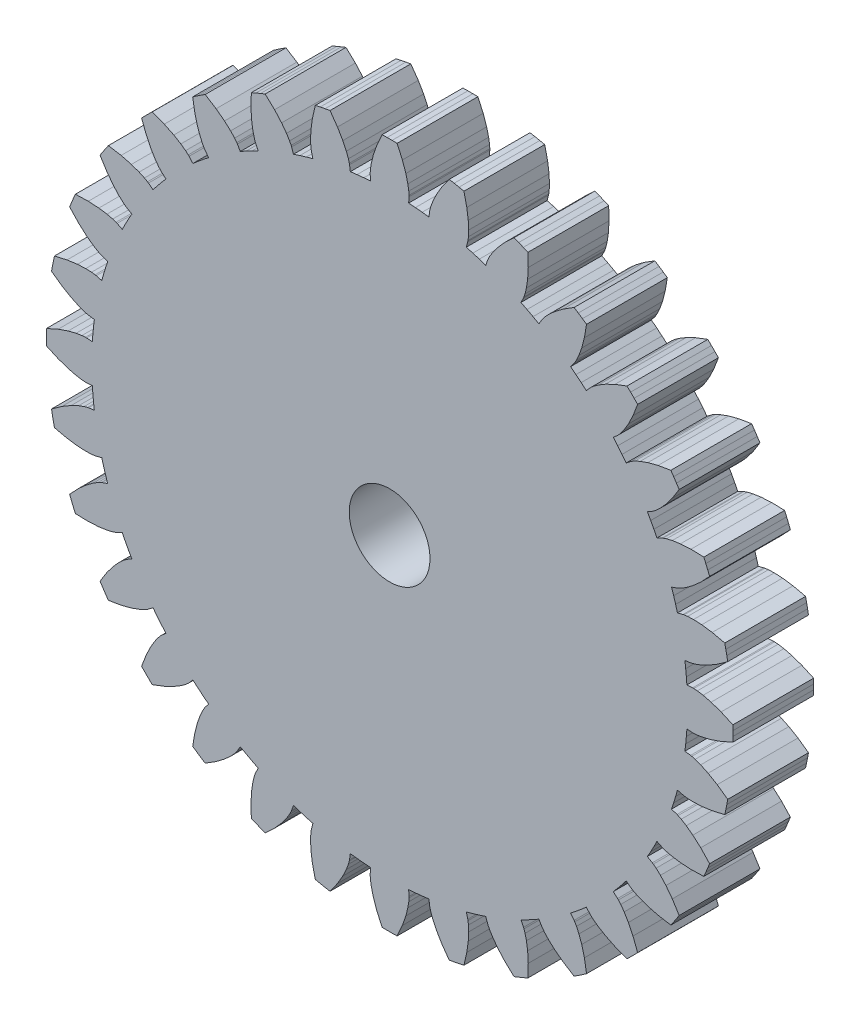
from build123d import *

# Parameters (mm, degrees)
SKETCH_1_R              = 3
SPURGEAR_M1_5_Z32_DEPTH = 6


with BuildPart() as part:
    # Sketch 1 → SpurGear_m1.5_z32 (new body)
    with BuildSketch(Plane.XY):
        Polygon((22.079715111, -1.414851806), (22.506462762, -1.442197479), (22.59366421, -1.442664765), (22.854554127, -1.423633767), (23.285036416, -1.354687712), (23.877027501, -1.206096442), (24.618555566, -0.949280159), (25.493910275, -0.557260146), (25.49932334, -0.185766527), (25.49932334, 0.185766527), (25.493910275, 0.557260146), (24.618555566, 0.949280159), (23.877027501, 1.206096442), (23.285036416, 1.354687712), (22.854554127, 1.423633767), (22.59366421, 1.442664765), (22.506462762, 1.442197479), (22.079715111, 1.414851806), (22.041742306, 1.917608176), (21.992323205, 2.419368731), (21.93148347, 2.919872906), (22.355366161, 2.976307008), (22.440983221, 2.99286086), (22.693147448, 3.06242328), (23.101907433, 3.214027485), (23.653534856, 3.475255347), (24.330712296, 3.871801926), (25.112767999, 4.427062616), (25.045602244, 4.792474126), (24.973119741, 5.156868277), (24.895335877, 5.520167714), (23.960321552, 5.73388194), (23.182939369, 5.841098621), (22.573334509, 5.87134302), (22.137673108, 5.854981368), (21.878083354, 5.822749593), (21.79264862, 5.805279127), (21.379435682, 5.695204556), (21.244109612, 6.180892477), (21.097751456, 6.663370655), (20.94043722, 7.142388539), (21.345165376, 7.280433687), (21.425907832, 7.313372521), (21.659655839, 7.430793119), (22.030985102, 7.659229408), (22.521050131, 8.023055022), (23.107853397, 8.544092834), (23.766556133, 9.241255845), (23.629392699, 9.586542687), (23.487213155, 9.929794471), (23.340047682, 10.270938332), (22.381305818, 10.298133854), (21.597943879, 10.251630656), (20.994152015, 10.162365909), (20.570053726, 10.061325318), (20.321740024, 9.979069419), (20.241355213, 9.945267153), (19.857556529, 9.756693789), (19.630077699, 10.206648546), (19.392404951, 10.651302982), (19.14466171, 11.090426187), (19.514681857, 11.304777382), (19.587446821, 11.352835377), (19.793795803, 11.513601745), (20.11342437, 11.810091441), (20.52309408, 12.262533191), (20.996972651, 12.888039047), (21.507008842, 13.700312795), (21.305118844, 14.012205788), (21.098706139, 14.321124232), (20.887814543, 14.62700255), (19.942189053, 14.466634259), (19.182951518, 14.268198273), (18.608176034, 14.062854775), (18.211938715, 13.881018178), (17.984443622, 13.751899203), (17.912197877, 13.70306414), (17.572562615, 13.443238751), (17.261672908, 13.840168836), (16.941819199, 14.229911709), (16.613167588, 14.612264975), (16.934260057, 14.894684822), (16.996251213, 14.956015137), (17.167271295, 15.153949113), (17.422916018, 15.507098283), (17.736447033, 16.030769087), (18.079190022, 16.736705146), (18.420959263, 17.632874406), (18.16210122, 17.899387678), (17.899387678, 18.16210122), (17.632874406, 18.420959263), (16.736705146, 18.079190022), (16.030769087, 17.736447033), (15.507098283, 17.422916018), (15.153949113, 17.167271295), (14.956015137, 16.996251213), (14.894684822, 16.934260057), (14.612264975, 16.613167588), (14.229911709, 16.941819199), (13.840168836, 17.261672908), (13.443238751, 17.572562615), (13.70306414, 17.912197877), (13.751899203, 17.984443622), (13.881018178, 18.211938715), (14.062854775, 18.608176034), (14.268198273, 19.182951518), (14.466634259, 19.942189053), (14.62700255, 20.887814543), (14.321124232, 21.098706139), (14.012205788, 21.305118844), (13.700312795, 21.507008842), (12.888039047, 20.996972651), (12.262533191, 20.52309408), (11.810091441, 20.11342437), (11.513601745, 19.793795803), (11.352835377, 19.587446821), (11.304777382, 19.514681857), (11.090426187, 19.14466171), (10.651302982, 19.392404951), (10.206648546, 19.630077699), (9.756693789, 19.857556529), (9.945267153, 20.241355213), (9.979069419, 20.321740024), (10.061325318, 20.570053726), (10.162365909, 20.994152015), (10.251630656, 21.597943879), (10.298133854, 22.381305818), (10.270938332, 23.340047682), (9.929794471, 23.487213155), (9.586542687, 23.629392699), (9.241255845, 23.766556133), (8.544092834, 23.107853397), (8.023055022, 22.521050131), (7.659229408, 22.030985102), (7.430793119, 21.659655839), (7.313372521, 21.425907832), (7.280433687, 21.345165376), (7.142388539, 20.94043722), (6.663370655, 21.097751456), (6.180892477, 21.244109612), (5.695204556, 21.379435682), (5.805279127, 21.79264862), (5.822749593, 21.878083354), (5.854981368, 22.137673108), (5.87134302, 22.573334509), (5.841098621, 23.182939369), (5.73388194, 23.960321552), (5.520167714, 24.895335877), (5.156868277, 24.973119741), (4.792474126, 25.045602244), (4.427062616, 25.112767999), (3.871801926, 24.330712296), (3.475255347, 23.653534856), (3.214027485, 23.101907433), (3.06242328, 22.693147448), (2.99286086, 22.440983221), (2.976307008, 22.355366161), (2.919872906, 21.93148347), (2.419368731, 21.992323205), (1.917608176, 22.041742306), (1.414851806, 22.079715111), (1.442197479, 22.506462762), (1.442664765, 22.59366421), (1.423633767, 22.854554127), (1.354687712, 23.285036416), (1.206096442, 23.877027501), (0.949280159, 24.618555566), (0.557260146, 25.493910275), (0.185766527, 25.49932334), (-0.185766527, 25.49932334), (-0.557260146, 25.493910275), (-0.949280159, 24.618555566), (-1.206096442, 23.877027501), (-1.354687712, 23.285036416), (-1.423633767, 22.854554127), (-1.442664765, 22.59366421), (-1.442197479, 22.506462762), (-1.414851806, 22.079715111), (-1.917608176, 22.041742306), (-2.419368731, 21.992323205), (-2.919872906, 21.93148347), (-2.976307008, 22.355366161), (-2.99286086, 22.440983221), (-3.06242328, 22.693147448), (-3.214027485, 23.101907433), (-3.475255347, 23.653534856), (-3.871801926, 24.330712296), (-4.427062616, 25.112767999), (-4.792474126, 25.045602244), (-5.156868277, 24.973119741), (-5.520167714, 24.895335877), (-5.73388194, 23.960321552), (-5.841098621, 23.182939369), (-5.87134302, 22.573334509), (-5.854981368, 22.137673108), (-5.822749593, 21.878083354), (-5.805279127, 21.79264862), (-5.695204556, 21.379435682), (-6.180892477, 21.244109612), (-6.663370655, 21.097751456), (-7.142388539, 20.94043722), (-7.280433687, 21.345165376), (-7.313372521, 21.425907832), (-7.430793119, 21.659655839), (-7.659229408, 22.030985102), (-8.023055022, 22.521050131), (-8.544092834, 23.107853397), (-9.241255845, 23.766556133), (-9.586542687, 23.629392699), (-9.929794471, 23.487213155), (-10.270938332, 23.340047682), (-10.298133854, 22.381305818), (-10.251630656, 21.597943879), (-10.162365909, 20.994152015), (-10.061325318, 20.570053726), (-9.979069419, 20.321740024), (-9.945267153, 20.241355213), (-9.756693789, 19.857556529), (-10.206648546, 19.630077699), (-10.651302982, 19.392404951), (-11.090426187, 19.14466171), (-11.304777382, 19.514681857), (-11.352835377, 19.587446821), (-11.513601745, 19.793795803), (-11.810091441, 20.11342437), (-12.262533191, 20.52309408), (-12.888039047, 20.996972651), (-13.700312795, 21.507008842), (-14.012205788, 21.305118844), (-14.321124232, 21.098706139), (-14.62700255, 20.887814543), (-14.466634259, 19.942189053), (-14.268198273, 19.182951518), (-14.062854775, 18.608176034), (-13.881018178, 18.211938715), (-13.751899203, 17.984443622), (-13.70306414, 17.912197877), (-13.443238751, 17.572562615), (-13.840168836, 17.261672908), (-14.229911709, 16.941819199), (-14.612264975, 16.613167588), (-14.894684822, 16.934260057), (-14.956015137, 16.996251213), (-15.153949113, 17.167271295), (-15.507098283, 17.422916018), (-16.030769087, 17.736447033), (-16.736705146, 18.079190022), (-17.632874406, 18.420959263), (-17.899387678, 18.16210122), (-18.16210122, 17.899387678), (-18.420959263, 17.632874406), (-18.079190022, 16.736705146), (-17.736447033, 16.030769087), (-17.422916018, 15.507098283), (-17.167271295, 15.153949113), (-16.996251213, 14.956015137), (-16.934260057, 14.894684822), (-16.613167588, 14.612264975), (-16.941819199, 14.229911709), (-17.261672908, 13.840168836), (-17.572562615, 13.443238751), (-17.912197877, 13.70306414), (-17.984443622, 13.751899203), (-18.211938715, 13.881018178), (-18.608176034, 14.062854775), (-19.182951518, 14.268198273), (-19.942189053, 14.466634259), (-20.887814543, 14.62700255), (-21.098706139, 14.321124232), (-21.305118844, 14.012205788), (-21.507008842, 13.700312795), (-20.996972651, 12.888039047), (-20.52309408, 12.262533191), (-20.11342437, 11.810091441), (-19.793795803, 11.513601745), (-19.587446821, 11.352835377), (-19.514681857, 11.304777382), (-19.14466171, 11.090426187), (-19.392404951, 10.651302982), (-19.630077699, 10.206648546), (-19.857556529, 9.756693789), (-20.241355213, 9.945267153), (-20.321740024, 9.979069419), (-20.570053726, 10.061325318), (-20.994152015, 10.162365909), (-21.597943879, 10.251630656), (-22.381305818, 10.298133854), (-23.340047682, 10.270938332), (-23.487213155, 9.929794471), (-23.629392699, 9.586542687), (-23.766556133, 9.241255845), (-23.107853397, 8.544092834), (-22.521050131, 8.023055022), (-22.030985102, 7.659229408), (-21.659655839, 7.430793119), (-21.425907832, 7.313372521), (-21.345165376, 7.280433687), (-20.94043722, 7.142388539), (-21.097751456, 6.663370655), (-21.244109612, 6.180892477), (-21.379435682, 5.695204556), (-21.79264862, 5.805279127), (-21.878083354, 5.822749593), (-22.137673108, 5.854981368), (-22.573334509, 5.87134302), (-23.182939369, 5.841098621), (-23.960321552, 5.73388194), (-24.895335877, 5.520167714), (-24.973119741, 5.156868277), (-25.045602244, 4.792474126), (-25.112767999, 4.427062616), (-24.330712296, 3.871801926), (-23.653534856, 3.475255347), (-23.101907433, 3.214027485), (-22.693147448, 3.06242328), (-22.440983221, 2.99286086), (-22.355366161, 2.976307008), (-21.93148347, 2.919872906), (-21.992323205, 2.419368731), (-22.041742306, 1.917608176), (-22.079715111, 1.414851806), (-22.506462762, 1.442197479), (-22.59366421, 1.442664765), (-22.854554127, 1.423633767), (-23.285036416, 1.354687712), (-23.877027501, 1.206096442), (-24.618555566, 0.949280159), (-25.493910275, 0.557260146), (-25.49932334, 0.185766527), (-25.49932334, -0.185766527), (-25.493910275, -0.557260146), (-24.618555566, -0.949280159), (-23.877027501, -1.206096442), (-23.285036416, -1.354687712), (-22.854554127, -1.423633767), (-22.59366421, -1.442664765), (-22.506462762, -1.442197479), (-22.079715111, -1.414851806), (-22.041742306, -1.917608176), (-21.992323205, -2.419368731), (-21.93148347, -2.919872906), (-22.355366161, -2.976307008), (-22.440983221, -2.99286086), (-22.693147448, -3.06242328), (-23.101907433, -3.214027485), (-23.653534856, -3.475255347), (-24.330712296, -3.871801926), (-25.112767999, -4.427062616), (-25.045602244, -4.792474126), (-24.973119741, -5.156868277), (-24.895335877, -5.520167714), (-23.960321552, -5.73388194), (-23.182939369, -5.841098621), (-22.573334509, -5.87134302), (-22.137673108, -5.854981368), (-21.878083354, -5.822749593), (-21.79264862, -5.805279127), (-21.379435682, -5.695204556), (-21.244109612, -6.180892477), (-21.097751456, -6.663370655), (-20.94043722, -7.142388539), (-21.345165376, -7.280433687), (-21.425907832, -7.313372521), (-21.659655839, -7.430793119), (-22.030985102, -7.659229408), (-22.521050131, -8.023055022), (-23.107853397, -8.544092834), (-23.766556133, -9.241255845), (-23.629392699, -9.586542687), (-23.487213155, -9.929794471), (-23.340047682, -10.270938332), (-22.381305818, -10.298133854), (-21.597943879, -10.251630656), (-20.994152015, -10.162365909), (-20.570053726, -10.061325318), (-20.321740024, -9.979069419), (-20.241355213, -9.945267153), (-19.857556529, -9.756693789), (-19.630077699, -10.206648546), (-19.392404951, -10.651302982), (-19.14466171, -11.090426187), (-19.514681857, -11.304777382), (-19.587446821, -11.352835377), (-19.793795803, -11.513601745), (-20.11342437, -11.810091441), (-20.52309408, -12.262533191), (-20.996972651, -12.888039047), (-21.507008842, -13.700312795), (-21.305118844, -14.012205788), (-21.098706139, -14.321124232), (-20.887814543, -14.62700255), (-19.942189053, -14.466634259), (-19.182951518, -14.268198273), (-18.608176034, -14.062854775), (-18.211938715, -13.881018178), (-17.984443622, -13.751899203), (-17.912197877, -13.70306414), (-17.572562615, -13.443238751), (-17.261672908, -13.840168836), (-16.941819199, -14.229911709), (-16.613167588, -14.612264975), (-16.934260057, -14.894684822), (-16.996251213, -14.956015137), (-17.167271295, -15.153949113), (-17.422916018, -15.507098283), (-17.736447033, -16.030769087), (-18.079190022, -16.736705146), (-18.420959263, -17.632874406), (-18.16210122, -17.899387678), (-17.899387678, -18.16210122), (-17.632874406, -18.420959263), (-16.736705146, -18.079190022), (-16.030769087, -17.736447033), (-15.507098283, -17.422916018), (-15.153949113, -17.167271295), (-14.956015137, -16.996251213), (-14.894684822, -16.934260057), (-14.612264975, -16.613167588), (-14.229911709, -16.941819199), (-13.840168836, -17.261672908), (-13.443238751, -17.572562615), (-13.70306414, -17.912197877), (-13.751899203, -17.984443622), (-13.881018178, -18.211938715), (-14.062854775, -18.608176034), (-14.268198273, -19.182951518), (-14.466634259, -19.942189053), (-14.62700255, -20.887814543), (-14.321124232, -21.098706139), (-14.012205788, -21.305118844), (-13.700312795, -21.507008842), (-12.888039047, -20.996972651), (-12.262533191, -20.52309408), (-11.810091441, -20.11342437), (-11.513601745, -19.793795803), (-11.352835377, -19.587446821), (-11.304777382, -19.514681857), (-11.090426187, -19.14466171), (-10.651302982, -19.392404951), (-10.206648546, -19.630077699), (-9.756693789, -19.857556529), (-9.945267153, -20.241355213), (-9.979069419, -20.321740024), (-10.061325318, -20.570053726), (-10.162365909, -20.994152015), (-10.251630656, -21.597943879), (-10.298133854, -22.381305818), (-10.270938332, -23.340047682), (-9.929794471, -23.487213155), (-9.586542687, -23.629392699), (-9.241255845, -23.766556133), (-8.544092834, -23.107853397), (-8.023055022, -22.521050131), (-7.659229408, -22.030985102), (-7.430793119, -21.659655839), (-7.313372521, -21.425907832), (-7.280433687, -21.345165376), (-7.142388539, -20.94043722), (-6.663370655, -21.097751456), (-6.180892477, -21.244109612), (-5.695204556, -21.379435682), (-5.805279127, -21.79264862), (-5.822749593, -21.878083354), (-5.854981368, -22.137673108), (-5.87134302, -22.573334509), (-5.841098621, -23.182939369), (-5.73388194, -23.960321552), (-5.520167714, -24.895335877), (-5.156868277, -24.973119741), (-4.792474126, -25.045602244), (-4.427062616, -25.112767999), (-3.871801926, -24.330712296), (-3.475255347, -23.653534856), (-3.214027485, -23.101907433), (-3.06242328, -22.693147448), (-2.99286086, -22.440983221), (-2.976307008, -22.355366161), (-2.919872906, -21.93148347), (-2.419368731, -21.992323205), (-1.917608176, -22.041742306), (-1.414851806, -22.079715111), (-1.442197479, -22.506462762), (-1.442664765, -22.59366421), (-1.423633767, -22.854554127), (-1.354687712, -23.285036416), (-1.206096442, -23.877027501), (-0.949280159, -24.618555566), (-0.557260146, -25.493910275), (-0.185766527, -25.49932334), (0.185766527, -25.49932334), (0.557260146, -25.493910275), (0.949280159, -24.618555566), (1.206096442, -23.877027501), (1.354687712, -23.285036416), (1.423633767, -22.854554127), (1.442664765, -22.59366421), (1.442197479, -22.506462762), (1.414851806, -22.079715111), (1.917608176, -22.041742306), (2.419368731, -21.992323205), (2.919872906, -21.93148347), (2.976307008, -22.355366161), (2.99286086, -22.440983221), (3.06242328, -22.693147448), (3.214027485, -23.101907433), (3.475255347, -23.653534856), (3.871801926, -24.330712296), (4.427062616, -25.112767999), (4.792474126, -25.045602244), (5.156868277, -24.973119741), (5.520167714, -24.895335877), (5.73388194, -23.960321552), (5.841098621, -23.182939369), (5.87134302, -22.573334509), (5.854981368, -22.137673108), (5.822749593, -21.878083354), (5.805279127, -21.79264862), (5.695204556, -21.379435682), (6.180892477, -21.244109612), (6.663370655, -21.097751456), (7.142388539, -20.94043722), (7.280433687, -21.345165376), (7.313372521, -21.425907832), (7.430793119, -21.659655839), (7.659229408, -22.030985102), (8.023055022, -22.521050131), (8.544092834, -23.107853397), (9.241255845, -23.766556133), (9.586542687, -23.629392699), (9.929794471, -23.487213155), (10.270938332, -23.340047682), (10.298133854, -22.381305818), (10.251630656, -21.597943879), (10.162365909, -20.994152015), (10.061325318, -20.570053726), (9.979069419, -20.321740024), (9.945267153, -20.241355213), (9.756693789, -19.857556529), (10.206648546, -19.630077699), (10.651302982, -19.392404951), (11.090426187, -19.14466171), (11.304777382, -19.514681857), (11.352835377, -19.587446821), (11.513601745, -19.793795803), (11.810091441, -20.11342437), (12.262533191, -20.52309408), (12.888039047, -20.996972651), (13.700312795, -21.507008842), (14.012205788, -21.305118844), (14.321124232, -21.098706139), (14.62700255, -20.887814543), (14.466634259, -19.942189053), (14.268198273, -19.182951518), (14.062854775, -18.608176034), (13.881018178, -18.211938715), (13.751899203, -17.984443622), (13.70306414, -17.912197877), (13.443238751, -17.572562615), (13.840168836, -17.261672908), (14.229911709, -16.941819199), (14.612264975, -16.613167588), (14.894684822, -16.934260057), (14.956015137, -16.996251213), (15.153949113, -17.167271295), (15.507098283, -17.422916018), (16.030769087, -17.736447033), (16.736705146, -18.079190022), (17.632874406, -18.420959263), (17.899387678, -18.16210122), (18.16210122, -17.899387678), (18.420959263, -17.632874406), (18.079190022, -16.736705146), (17.736447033, -16.030769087), (17.422916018, -15.507098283), (17.167271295, -15.153949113), (16.996251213, -14.956015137), (16.934260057, -14.894684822), (16.613167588, -14.612264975), (16.941819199, -14.229911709), (17.261672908, -13.840168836), (17.572562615, -13.443238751), (17.912197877, -13.70306414), (17.984443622, -13.751899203), (18.211938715, -13.881018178), (18.608176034, -14.062854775), (19.182951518, -14.268198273), (19.942189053, -14.466634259), (20.887814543, -14.62700255), (21.098706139, -14.321124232), (21.305118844, -14.012205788), (21.507008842, -13.700312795), (20.996972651, -12.888039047), (20.52309408, -12.262533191), (20.11342437, -11.810091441), (19.793795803, -11.513601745), (19.587446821, -11.352835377), (19.514681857, -11.304777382), (19.14466171, -11.090426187), (19.392404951, -10.651302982), (19.630077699, -10.206648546), (19.857556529, -9.756693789), (20.241355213, -9.945267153), (20.321740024, -9.979069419), (20.570053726, -10.061325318), (20.994152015, -10.162365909), (21.597943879, -10.251630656), (22.381305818, -10.298133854), (23.340047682, -10.270938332), (23.487213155, -9.929794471), (23.629392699, -9.586542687), (23.766556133, -9.241255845), (23.107853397, -8.544092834), (22.521050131, -8.023055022), (22.030985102, -7.659229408), (21.659655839, -7.430793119), (21.425907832, -7.313372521), (21.345165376, -7.280433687), (20.94043722, -7.142388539), (21.097751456, -6.663370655), (21.244109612, -6.180892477), (21.379435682, -5.695204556), (21.79264862, -5.805279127), (21.878083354, -5.822749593), (22.137673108, -5.854981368), (22.573334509, -5.87134302), (23.182939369, -5.841098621), (23.960321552, -5.73388194), (24.895335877, -5.520167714), (24.973119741, -5.156868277), (25.045602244, -4.792474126), (25.112767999, -4.427062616), (24.330712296, -3.871801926), (23.653534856, -3.475255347), (23.101907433, -3.214027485), (22.693147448, -3.06242328), (22.440983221, -2.99286086), (22.355366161, -2.976307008), (21.93148347, -2.919872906), (21.992323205, -2.419368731), (22.041742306, -1.917608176), align=None)
        Circle(SKETCH_1_R, mode=Mode.SUBTRACT)
    extrude(amount=-SPURGEAR_M1_5_Z32_DEPTH)


solid = part.part
